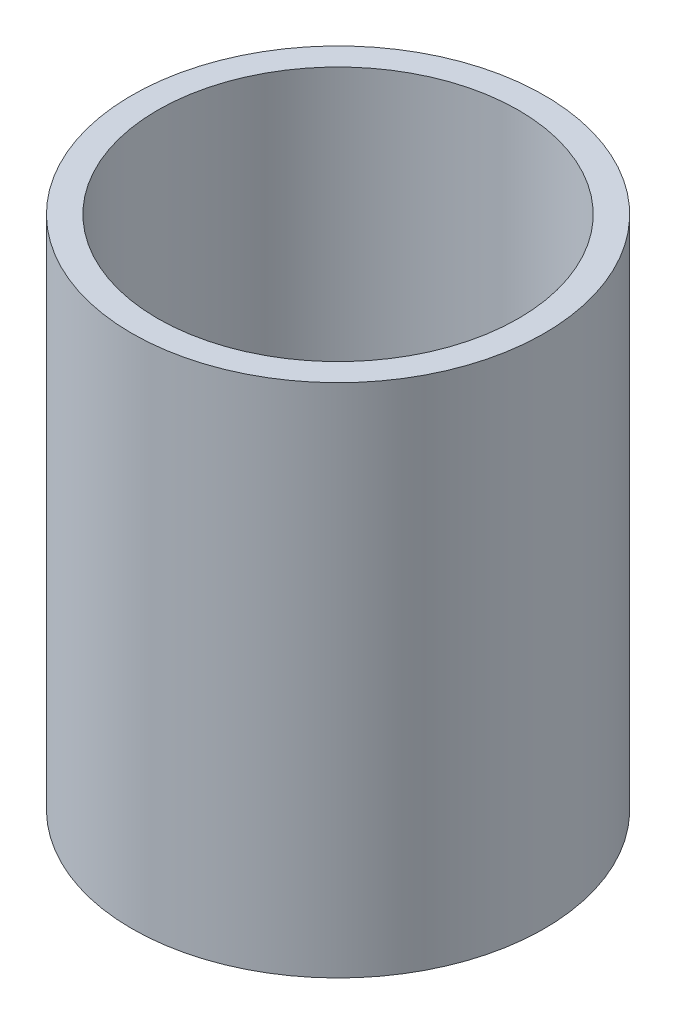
ISO-10303-21;
HEADER;
FILE_DESCRIPTION(('STEP AP214'),'2;1');
FILE_NAME('part.step','',(''),(''),'','','');
FILE_SCHEMA(('AUTOMOTIVE_DESIGN { 1 0 10303 214 1 1 1 1 }'));
ENDSEC;
DATA;
#1=APPLICATION_CONTEXT('core data for automotive mechanical design processes');
#2=APPLICATION_PROTOCOL_DEFINITION('international standard','automotive_design',2000,#1);
#3=PRODUCT_CONTEXT('',#1,'mechanical');
#4=PRODUCT('Part','Part','',(#3));
#5=PRODUCT_RELATED_PRODUCT_CATEGORY('part','',(#4));
#6=PRODUCT_DEFINITION_FORMATION('','',#4);
#7=PRODUCT_DEFINITION_CONTEXT('part definition',#1,'design');
#8=PRODUCT_DEFINITION('design','',#6,#7);
#9=PRODUCT_DEFINITION_SHAPE('','',#8);
#10=(LENGTH_UNIT() NAMED_UNIT(*) SI_UNIT(.MILLI.,.METRE.));
#11=(NAMED_UNIT(*) PLANE_ANGLE_UNIT() SI_UNIT($,.RADIAN.));
#12=(NAMED_UNIT(*) SI_UNIT($,.STERADIAN.) SOLID_ANGLE_UNIT());
#13=UNCERTAINTY_MEASURE_WITH_UNIT(LENGTH_MEASURE(1.E-05),#10,'distance_accuracy_value','');
#14=(GEOMETRIC_REPRESENTATION_CONTEXT(3) GLOBAL_UNCERTAINTY_ASSIGNED_CONTEXT((#13)) GLOBAL_UNIT_ASSIGNED_CONTEXT((#10,
#11,#12)) REPRESENTATION_CONTEXT('',''));
#15=CARTESIAN_POINT('',(0.,0.,0.));
#16=DIRECTION('',(0.,0.,1.));
#17=DIRECTION('',(1.,0.,0.));
#18=AXIS2_PLACEMENT_3D('',#15,#16,#17);
#19=CARTESIAN_POINT('',(0.,31.75,0.));
#20=DIRECTION('',(0.,-1.,0.));
#21=DIRECTION('',(0.,0.,-1.));
#22=AXIS2_PLACEMENT_3D('',#19,#20,#21);
#23=CYLINDRICAL_SURFACE('',#22,12.7);
#24=CARTESIAN_POINT('',(0.,31.75,0.));
#25=DIRECTION('',(0.,1.,0.));
#26=DIRECTION('',(0.,0.,1.));
#27=AXIS2_PLACEMENT_3D('',#24,#25,#26);
#28=CIRCLE('',#27,12.7);
#29=CARTESIAN_POINT('',(0.,31.75,12.7));
#30=VERTEX_POINT('',#29);
#31=EDGE_CURVE('E10',#30,#30,#28,.T.);
#32=ORIENTED_EDGE('',*,*,#31,.F.);
#33=EDGE_LOOP('',(#32));
#34=FACE_BOUND('',#33,.T.);
#35=CARTESIAN_POINT('',(0.,0.,0.));
#36=DIRECTION('',(0.,1.,0.));
#37=DIRECTION('',(0.,0.,1.));
#38=AXIS2_PLACEMENT_3D('',#35,#36,#37);
#39=CIRCLE('',#38,12.7);
#40=CARTESIAN_POINT('',(0.,0.,12.7));
#41=VERTEX_POINT('',#40);
#42=EDGE_CURVE('E32',#41,#41,#39,.T.);
#43=ORIENTED_EDGE('',*,*,#42,.T.);
#44=EDGE_LOOP('',(#43));
#45=FACE_BOUND('',#44,.T.);
#46=ADVANCED_FACE('F29',(#34,#45),#23,.T.);
#47=CARTESIAN_POINT('',(0.,31.75,0.));
#48=DIRECTION('',(0.,1.,0.));
#49=DIRECTION('',(0.,0.,1.));
#50=AXIS2_PLACEMENT_3D('',#47,#48,#49);
#51=PLANE('',#50);
#52=CARTESIAN_POINT('',(0.,31.75,0.));
#53=DIRECTION('',(0.,1.,0.));
#54=DIRECTION('',(0.,0.,1.));
#55=AXIS2_PLACEMENT_3D('',#52,#53,#54);
#56=CIRCLE('',#55,11.1125);
#57=CARTESIAN_POINT('',(0.,31.75,11.1125));
#58=VERTEX_POINT('',#57);
#59=EDGE_CURVE('E41',#58,#58,#56,.T.);
#60=ORIENTED_EDGE('',*,*,#59,.F.);
#61=EDGE_LOOP('',(#60));
#62=FACE_BOUND('',#61,.T.);
#63=ORIENTED_EDGE('',*,*,#31,.T.);
#64=EDGE_LOOP('',(#63));
#65=FACE_BOUND('',#64,.T.);
#66=ADVANCED_FACE('F56',(#62,#65),#51,.T.);
#67=CARTESIAN_POINT('',(0.,0.,0.));
#68=DIRECTION('',(0.,1.,0.));
#69=DIRECTION('',(0.,0.,1.));
#70=AXIS2_PLACEMENT_3D('',#67,#68,#69);
#71=PLANE('',#70);
#72=CARTESIAN_POINT('',(0.,0.,0.));
#73=DIRECTION('',(0.,1.,0.));
#74=DIRECTION('',(0.,0.,1.));
#75=AXIS2_PLACEMENT_3D('',#72,#73,#74);
#76=CIRCLE('',#75,11.1125);
#77=CARTESIAN_POINT('',(0.,0.,11.1125));
#78=VERTEX_POINT('',#77);
#79=EDGE_CURVE('E39',#78,#78,#76,.T.);
#80=ORIENTED_EDGE('',*,*,#79,.T.);
#81=EDGE_LOOP('',(#80));
#82=FACE_BOUND('',#81,.T.);
#83=ORIENTED_EDGE('',*,*,#42,.F.);
#84=EDGE_LOOP('',(#83));
#85=FACE_BOUND('',#84,.T.);
#86=ADVANCED_FACE('F47',(#82,#85),#71,.F.);
#87=CARTESIAN_POINT('',(0.,0.,0.));
#88=DIRECTION('',(0.,1.,0.));
#89=DIRECTION('',(0.,0.,1.));
#90=AXIS2_PLACEMENT_3D('',#87,#88,#89);
#91=CYLINDRICAL_SURFACE('',#90,11.1125);
#92=ORIENTED_EDGE('',*,*,#79,.F.);
#93=EDGE_LOOP('',(#92));
#94=FACE_BOUND('',#93,.T.);
#95=ORIENTED_EDGE('',*,*,#59,.T.);
#96=EDGE_LOOP('',(#95));
#97=FACE_BOUND('',#96,.T.);
#98=ADVANCED_FACE('F50',(#94,#97),#91,.F.);
#99=CLOSED_SHELL('',(#46,#66,#86,#98));
#100=MANIFOLD_SOLID_BREP('B2',#99);
#101=ADVANCED_BREP_SHAPE_REPRESENTATION('',(#18,#100),#14);
#102=SHAPE_DEFINITION_REPRESENTATION(#9,#101);
ENDSEC;
END-ISO-10303-21;
